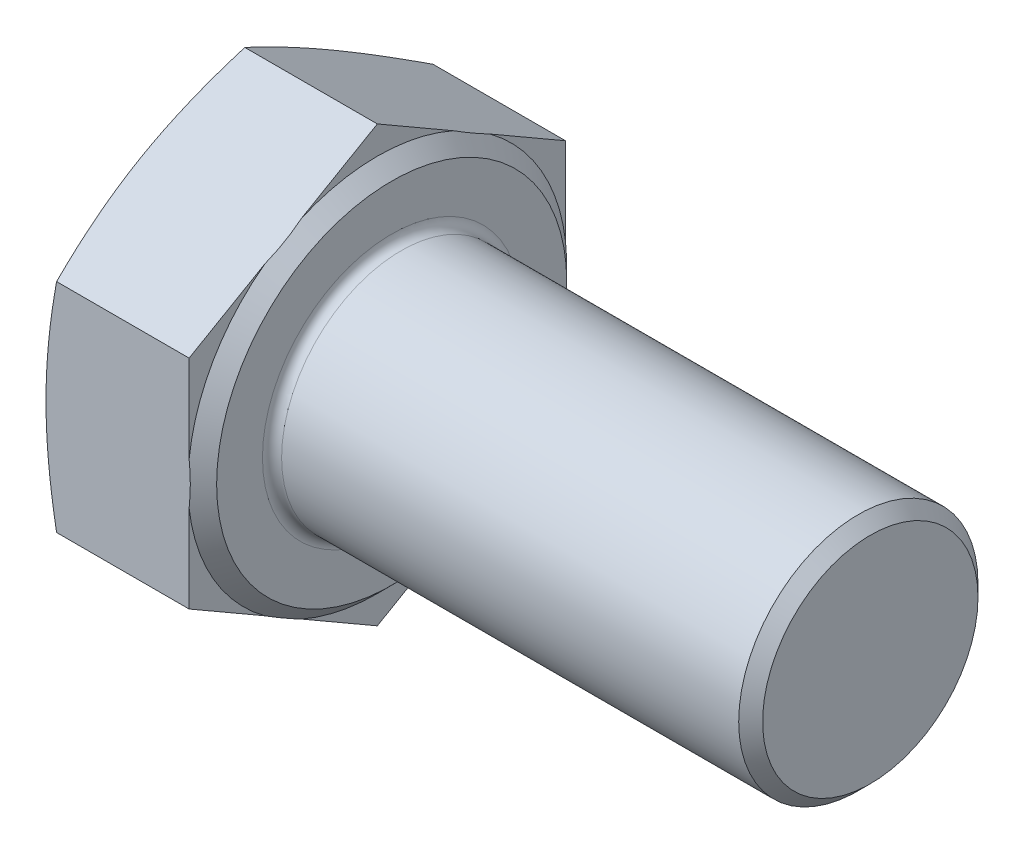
from build123d import *

# Parameters (mm, degrees)
BASEHEAD_DEPTH = 6.58
SKETCH5_R      = 5
BASEBODY_DEPTH = 20
CHAMFER1_SIZE  = 0.5
HEADFILLET_R   = 0.4


with BuildPart() as part:
    # Sketch2 → BaseHead (new body)
    with BuildSketch(Plane(origin=(0, 0, 0), x_dir=(0, 0, -1), z_dir=(1, 0, 0))):
        Polygon((7.865, -4.540859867), (7.865, 4.540859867), (0, 9.081719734), (-7.865, 4.540859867), (-7.865, -4.540859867), (0, -9.081719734), align=None)
    extrude(amount=BASEHEAD_DEPTH)

    # Sketch3 → BearingFace (revolve, cut)
    with BuildSketch(Plane.XY, mode=Mode.PRIVATE) as bearingface_sk:
        Polygon((6.58, 9.081719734), (6.58, 7.315), (5.98, 7.915), (5.98, 9.081719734), align=None)
    revolve(bearingface_sk.sketch.rotate(Axis((-0.957090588, 0, 0), (1, 0, 0)), 90), axis=Axis((-0.957090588, 0, 0), (1, 0, 0)), mode=Mode.SUBTRACT)

    # Sketch4 → HeadChamfer (revolve, cut)
    with BuildSketch(Plane.XY):
        Polygon((0, 9.081719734), (0.442849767, 9.081719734), (0, 7.865), align=None)
    revolve(axis=Axis((-0.493528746, 0, 0), (1, 0, 0)), mode=Mode.SUBTRACT)

    # Sketch5 → BaseBody (add)
    with BuildSketch(Plane(origin=(6.58, 0, 0), x_dir=(0, 0, -1), z_dir=(1, 0, 0))):
        with Locations(Location((0, 0, 0), (0, 0, 180))):
            Circle(SKETCH5_R)
    extrude(amount=BASEBODY_DEPTH)

    # Chamfer1
    chamfer1_edges = [part.edges().sort_by_distance(p)[0] for p in [
        (26.58, 0, -5),
    ]]
    chamfer(chamfer1_edges, length=CHAMFER1_SIZE)

    # HeadFillet
    headfillet_edges = [part.edges().sort_by_distance(p)[0] for p in [
        (6.58, 0, -5),
    ]]
    fillet(headfillet_edges, radius=HEADFILLET_R)


solid = part.part
